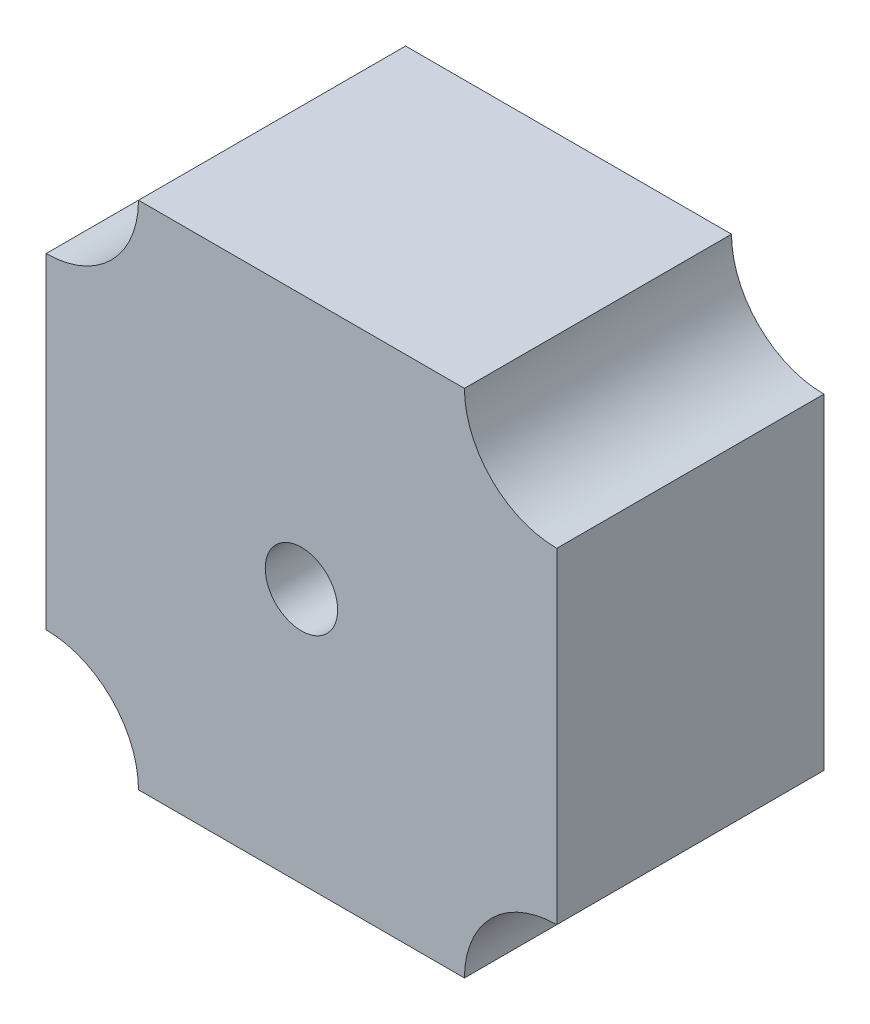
from build123d import *

# Parameters (mm, degrees)
EXTRUDE_1_DEPTH     = 29.5
SKETCH_2_R          = 4
CUT_EXTRUDE_1_DEPTH = 29.5


with BuildPart() as part:
    # Sketch 1 → Extrude 1 (new body)
    with BuildSketch(Plane.XY):
        with BuildLine():
            Line((18, -28.2), (-18, -28.2))
            ThreePointArc((-18, -28.2), (-20.987510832, -20.987510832), (-28.2, -18))
            Line((-28.2, -18), (-28.2, 18))
            ThreePointArc((-28.2, 18), (-20.987510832, 20.987510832), (-18, 28.2))
            Line((-18, 28.2), (18, 28.2))
            ThreePointArc((18, 28.2), (20.987510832, 20.987510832), (28.2, 18))
            Line((28.2, 18), (28.2, -18))
            ThreePointArc((28.2, -18), (20.987510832, -20.987510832), (18, -28.2))
        make_face()
    extrude(amount=EXTRUDE_1_DEPTH)

    # Sketch 2 → Cut-Extrude 1 (cut)
    with BuildSketch(Plane(origin=(0, 0, 0), x_dir=(-1, 0, 0), z_dir=(0, 0, -1))):
        Circle(SKETCH_2_R)
    extrude(amount=-CUT_EXTRUDE_1_DEPTH, mode=Mode.SUBTRACT)


solid = part.part
